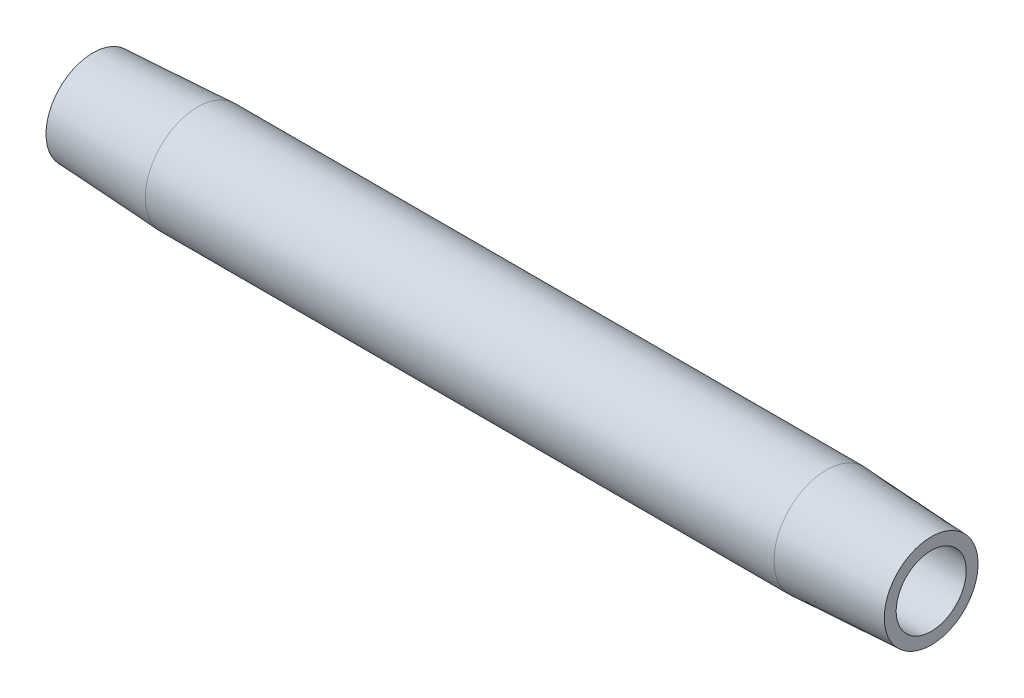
from build123d import *


with BuildPart() as part:
    # Sketch2 → Revolve1 (revolve)
    with BuildSketch(Plane.XY, mode=Mode.PRIVATE) as revolve1_sk:
        Polygon((7.9375, 3.96875), (0, 3.552763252), (0, 2.6543), (63.5, 2.6543), (63.5, 3.552763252), (55.5625, 3.96875), align=None)
    revolve(revolve1_sk.sketch.rotate(Axis((0.476141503, 0, 0), (1, 0, 0)), 90), axis=Axis((0.476141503, 0, 0), (1, 0, 0)))


solid = part.part
